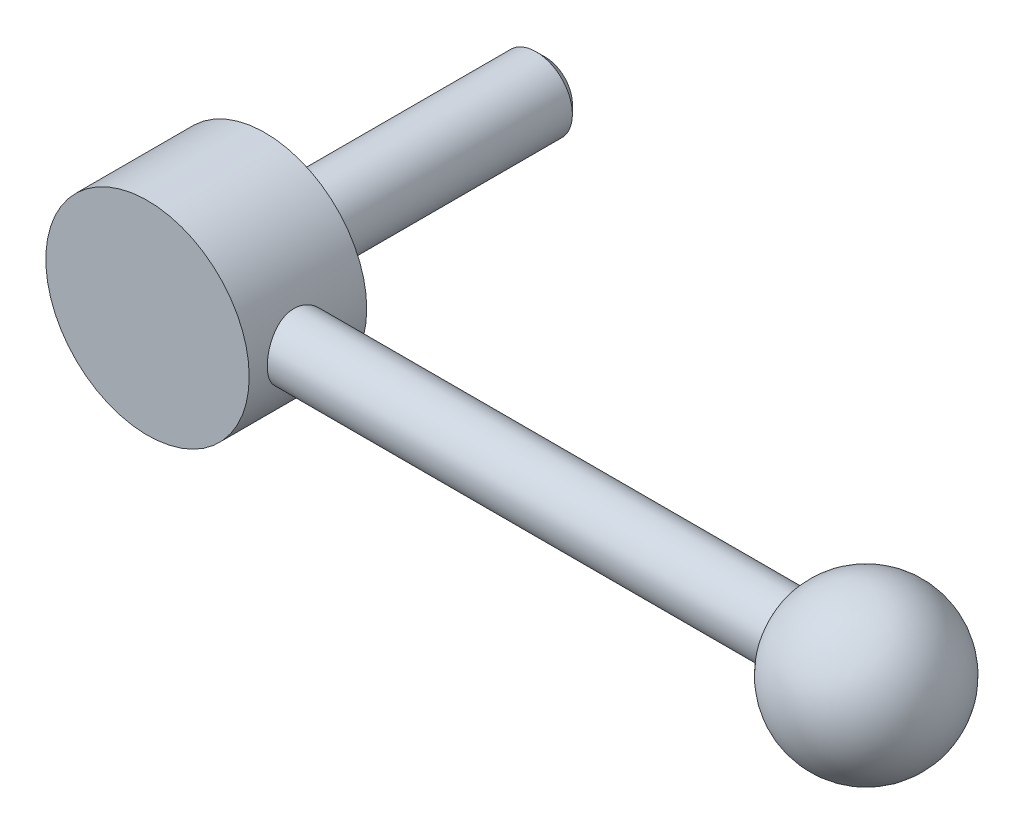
ISO-10303-21;
HEADER;
FILE_DESCRIPTION(('STEP AP214'),'2;1');
FILE_NAME('part.step','',(''),(''),'','','');
FILE_SCHEMA(('AUTOMOTIVE_DESIGN { 1 0 10303 214 1 1 1 1 }'));
ENDSEC;
DATA;
#1=APPLICATION_CONTEXT('core data for automotive mechanical design processes');
#2=APPLICATION_PROTOCOL_DEFINITION('international standard','automotive_design',2000,#1);
#3=PRODUCT_CONTEXT('',#1,'mechanical');
#4=PRODUCT('Part','Part','',(#3));
#5=PRODUCT_RELATED_PRODUCT_CATEGORY('part','',(#4));
#6=PRODUCT_DEFINITION_FORMATION('','',#4);
#7=PRODUCT_DEFINITION_CONTEXT('part definition',#1,'design');
#8=PRODUCT_DEFINITION('design','',#6,#7);
#9=PRODUCT_DEFINITION_SHAPE('','',#8);
#10=(LENGTH_UNIT() NAMED_UNIT(*) SI_UNIT(.MILLI.,.METRE.));
#11=(NAMED_UNIT(*) PLANE_ANGLE_UNIT() SI_UNIT($,.RADIAN.));
#12=(NAMED_UNIT(*) SI_UNIT($,.STERADIAN.) SOLID_ANGLE_UNIT());
#13=UNCERTAINTY_MEASURE_WITH_UNIT(LENGTH_MEASURE(1.E-05),#10,'distance_accuracy_value','');
#14=(GEOMETRIC_REPRESENTATION_CONTEXT(3) GLOBAL_UNCERTAINTY_ASSIGNED_CONTEXT((#13)) GLOBAL_UNIT_ASSIGNED_CONTEXT((#10,
#11,#12)) REPRESENTATION_CONTEXT('',''));
#15=CARTESIAN_POINT('',(0.,0.,0.));
#16=DIRECTION('',(0.,0.,1.));
#17=DIRECTION('',(1.,0.,0.));
#18=AXIS2_PLACEMENT_3D('',#15,#16,#17);
#19=CARTESIAN_POINT('',(0.,0.,40.));
#20=DIRECTION('',(0.,0.,1.));
#21=DIRECTION('',(1.,0.,0.));
#22=AXIS2_PLACEMENT_3D('',#19,#20,#21);
#23=CYLINDRICAL_SURFACE('',#22,11.5);
#24=CARTESIAN_POINT('',(0.,0.,2.));
#25=DIRECTION('',(0.,0.,1.));
#26=DIRECTION('',(1.,0.,0.));
#27=AXIS2_PLACEMENT_3D('',#24,#25,#26);
#28=CIRCLE('',#27,11.5);
#29=CARTESIAN_POINT('',(11.5,0.,2.));
#30=VERTEX_POINT('',#29);
#31=EDGE_CURVE('E37',#30,#30,#28,.T.);
#32=ORIENTED_EDGE('',*,*,#31,.F.);
#33=EDGE_LOOP('',(#32));
#34=FACE_BOUND('',#33,.T.);
#35=CARTESIAN_POINT('',(0.,0.,0.));
#36=DIRECTION('',(0.,0.,1.));
#37=DIRECTION('',(1.,0.,0.));
#38=AXIS2_PLACEMENT_3D('',#35,#36,#37);
#39=CIRCLE('',#38,11.5);
#40=CARTESIAN_POINT('',(11.5,0.,0.));
#41=VERTEX_POINT('',#40);
#42=EDGE_CURVE('E23',#41,#41,#39,.T.);
#43=ORIENTED_EDGE('',*,*,#42,.T.);
#44=EDGE_LOOP('',(#43));
#45=FACE_BOUND('',#44,.T.);
#46=ADVANCED_FACE('F12',(#34,#45),#23,.T.);
#47=CARTESIAN_POINT('',(8.,0.,0.));
#48=DIRECTION('',(0.,0.,1.));
#49=DIRECTION('',(1.,0.,0.));
#50=AXIS2_PLACEMENT_3D('',#47,#48,#49);
#51=PLANE('',#50);
#52=ORIENTED_EDGE('',*,*,#42,.F.);
#53=EDGE_LOOP('',(#52));
#54=FACE_BOUND('',#53,.T.);
#55=CARTESIAN_POINT('',(0.,0.,0.));
#56=DIRECTION('',(0.,0.,1.));
#57=DIRECTION('',(1.,0.,0.));
#58=AXIS2_PLACEMENT_3D('',#55,#56,#57);
#59=CIRCLE('',#58,8.);
#60=CARTESIAN_POINT('',(8.,0.,0.));
#61=VERTEX_POINT('',#60);
#62=EDGE_CURVE('E27',#61,#61,#59,.T.);
#63=ORIENTED_EDGE('',*,*,#62,.T.);
#64=EDGE_LOOP('',(#63));
#65=FACE_BOUND('',#64,.T.);
#66=ADVANCED_FACE('F63',(#54,#65),#51,.F.);
#67=CARTESIAN_POINT('',(0.,0.,40.));
#68=DIRECTION('',(0.,0.,1.));
#69=DIRECTION('',(1.,0.,0.));
#70=AXIS2_PLACEMENT_3D('',#67,#68,#69);
#71=CYLINDRICAL_SURFACE('',#70,8.);
#72=CARTESIAN_POINT('',(0.,0.,-58.));
#73=DIRECTION('',(0.,0.,-1.));
#74=DIRECTION('',(-1.,0.,0.));
#75=AXIS2_PLACEMENT_3D('',#72,#73,#74);
#76=CIRCLE('',#75,8.);
#77=CARTESIAN_POINT('',(-8.,0.,-58.));
#78=VERTEX_POINT('',#77);
#79=EDGE_CURVE('E19',#78,#78,#76,.F.);
#80=ORIENTED_EDGE('',*,*,#79,.T.);
#81=EDGE_LOOP('',(#80));
#82=FACE_BOUND('',#81,.T.);
#83=ORIENTED_EDGE('',*,*,#62,.F.);
#84=EDGE_LOOP('',(#83));
#85=FACE_BOUND('',#84,.T.);
#86=ADVANCED_FACE('F69',(#82,#85),#71,.T.);
#87=CARTESIAN_POINT('',(8.,0.,-60.));
#88=DIRECTION('',(0.,0.,-1.));
#89=DIRECTION('',(-1.,0.,0.));
#90=AXIS2_PLACEMENT_3D('',#87,#88,#89);
#91=PLANE('',#90);
#92=CARTESIAN_POINT('',(0.,0.,-60.));
#93=DIRECTION('',(0.,0.,-1.));
#94=DIRECTION('',(-1.,0.,0.));
#95=AXIS2_PLACEMENT_3D('',#92,#93,#94);
#96=CIRCLE('',#95,6.);
#97=CARTESIAN_POINT('',(-6.,0.,-60.));
#98=VERTEX_POINT('',#97);
#99=EDGE_CURVE('E8',#98,#98,#96,.T.);
#100=ORIENTED_EDGE('',*,*,#99,.T.);
#101=EDGE_LOOP('',(#100));
#102=FACE_BOUND('',#101,.T.);
#103=ADVANCED_FACE('F77',(#102),#91,.T.);
#104=CARTESIAN_POINT('',(22.5,0.,28.));
#105=DIRECTION('',(0.,0.,-1.));
#106=DIRECTION('',(-1.,0.,0.));
#107=AXIS2_PLACEMENT_3D('',#104,#105,#106);
#108=PLANE('',#107);
#109=CARTESIAN_POINT('',(0.,0.,28.));
#110=DIRECTION('',(0.,0.,1.));
#111=DIRECTION('',(1.,0.,0.));
#112=AXIS2_PLACEMENT_3D('',#109,#110,#111);
#113=CIRCLE('',#112,22.5);
#114=CARTESIAN_POINT('',(22.5,0.,28.));
#115=VERTEX_POINT('',#114);
#116=EDGE_CURVE('E86',#115,#115,#113,.T.);
#117=ORIENTED_EDGE('',*,*,#116,.T.);
#118=EDGE_LOOP('',(#117));
#119=FACE_BOUND('',#118,.T.);
#120=ADVANCED_FACE('F58',(#119),#108,.F.);
#121=CARTESIAN_POINT('',(0.,0.,40.));
#122=DIRECTION('',(0.,0.,1.));
#123=DIRECTION('',(1.,0.,0.));
#124=AXIS2_PLACEMENT_3D('',#121,#122,#123);
#125=CYLINDRICAL_SURFACE('',#124,22.5);
#126=CARTESIAN_POINT('',(22.5,0.,10.));
#127=CARTESIAN_POINT('',(22.4999998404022,-0.191677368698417,10.0000002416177));
#128=CARTESIAN_POINT('',(22.4975448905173,-0.383358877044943,10.0078793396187));
#129=CARTESIAN_POINT('',(22.4877923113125,-0.765308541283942,10.0393229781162));
#130=CARTESIAN_POINT('',(22.4804945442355,-0.955576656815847,10.0628879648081));
#131=CARTESIAN_POINT('',(22.4612564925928,-1.33331254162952,10.1254869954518));
#132=CARTESIAN_POINT('',(22.4493161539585,-1.52078027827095,10.1645212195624));
#133=CARTESIAN_POINT('',(22.4211118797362,-1.89165112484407,10.2577281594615));
#134=CARTESIAN_POINT('',(22.4048463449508,-2.07505270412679,10.3119064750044));
#135=CARTESIAN_POINT('',(22.3684646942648,-2.43611329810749,10.4348153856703));
#136=CARTESIAN_POINT('',(22.3483561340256,-2.61378279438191,10.503517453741));
#137=CARTESIAN_POINT('',(22.3047888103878,-2.96265393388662,10.6550124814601));
#138=CARTESIAN_POINT('',(22.281328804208,-3.13385314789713,10.7378106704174));
#139=CARTESIAN_POINT('',(22.2316747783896,-3.46860942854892,10.9168465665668));
#140=CARTESIAN_POINT('',(22.2054814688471,-3.63216846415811,11.0130807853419));
#141=CARTESIAN_POINT('',(22.1510251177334,-3.95072830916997,11.2183306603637));
#142=CARTESIAN_POINT('',(22.1227612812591,-4.10572579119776,11.327351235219));
#143=CARTESIAN_POINT('',(22.0343532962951,-4.56462383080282,11.6788046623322));
#144=CARTESIAN_POINT('',(21.9719820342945,-4.85343322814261,11.9408249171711));
#145=CARTESIAN_POINT('',(21.8481078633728,-5.38374028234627,12.5092913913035));
#146=CARTESIAN_POINT('',(21.7866051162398,-5.62522922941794,12.8157457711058));
#147=CARTESIAN_POINT('',(21.6993823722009,-5.94977072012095,13.3067462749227));
#148=CARTESIAN_POINT('',(21.670827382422,-6.05269326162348,13.4779461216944));
#149=CARTESIAN_POINT('',(21.6165738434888,-6.24368405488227,13.8288405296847));
#150=CARTESIAN_POINT('',(21.5908741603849,-6.33175821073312,14.0085316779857));
#151=CARTESIAN_POINT('',(21.5431267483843,-6.49235835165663,14.3752387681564));
#152=CARTESIAN_POINT('',(21.5210797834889,-6.56488108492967,14.5622562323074));
#153=CARTESIAN_POINT('',(21.4813641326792,-6.69369414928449,14.9421700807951));
#154=CARTESIAN_POINT('',(21.4636935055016,-6.74999167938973,15.1350638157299));
#155=CARTESIAN_POINT('',(21.4337574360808,-6.84444485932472,15.5195916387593));
#156=CARTESIAN_POINT('',(21.4213480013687,-6.88308642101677,15.7110952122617));
#157=CARTESIAN_POINT('',(21.4016029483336,-6.94423696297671,16.0968445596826));
#158=CARTESIAN_POINT('',(21.3942652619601,-6.96675251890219,16.2910891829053));
#159=CARTESIAN_POINT('',(21.3848978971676,-6.99545358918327,16.6809027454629));
#160=CARTESIAN_POINT('',(21.382868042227,-7.00163964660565,16.8764716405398));
#161=CARTESIAN_POINT('',(21.3841835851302,-6.99762087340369,17.2674203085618));
#162=CARTESIAN_POINT('',(21.387528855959,-6.98741643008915,17.4628000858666));
#163=CARTESIAN_POINT('',(21.3992467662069,-6.95144410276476,17.8441910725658));
#164=CARTESIAN_POINT('',(21.4074162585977,-6.92630487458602,18.0302682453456));
#165=CARTESIAN_POINT('',(21.4283669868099,-6.86121389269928,18.3996136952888));
#166=CARTESIAN_POINT('',(21.4411497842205,-6.82125712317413,18.5828809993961));
#167=CARTESIAN_POINT('',(21.4709424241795,-6.7268919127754,18.9452428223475));
#168=CARTESIAN_POINT('',(21.4879510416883,-6.67248765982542,19.1243385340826));
#169=CARTESIAN_POINT('',(21.5257120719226,-6.54964475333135,19.4773149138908));
#170=CARTESIAN_POINT('',(21.5464659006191,-6.48120079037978,19.6511935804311));
#171=CARTESIAN_POINT('',(21.5914465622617,-6.32975192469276,19.9949996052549));
#172=CARTESIAN_POINT('',(21.6157183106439,-6.24655500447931,20.1648364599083));
#173=CARTESIAN_POINT('',(21.6668400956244,-6.06685791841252,20.4969847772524));
#174=CARTESIAN_POINT('',(21.6936910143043,-5.97035319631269,20.6592936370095));
#175=CARTESIAN_POINT('',(21.749239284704,-5.76471421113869,20.9753768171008));
#176=CARTESIAN_POINT('',(21.777936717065,-5.65557939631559,21.1291507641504));
#177=CARTESIAN_POINT('',(21.836423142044,-5.42537787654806,21.4272728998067));
#178=CARTESIAN_POINT('',(21.866212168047,-5.30431080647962,21.5716207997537));
#179=CARTESIAN_POINT('',(21.9274745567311,-5.0452320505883,21.8563713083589));
#180=CARTESIAN_POINT('',(21.958963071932,-4.90670110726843,21.9962986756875));
#181=CARTESIAN_POINT('',(22.0214157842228,-4.61833304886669,22.2639997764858));
#182=CARTESIAN_POINT('',(22.0523801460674,-4.46849957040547,22.3917773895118));
#183=CARTESIAN_POINT('',(22.1129608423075,-4.15835706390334,22.6344343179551));
#184=CARTESIAN_POINT('',(22.142576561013,-3.99804333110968,22.749307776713));
#185=CARTESIAN_POINT('',(22.1996210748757,-3.66808403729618,22.9652340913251));
#186=CARTESIAN_POINT('',(22.2270507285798,-3.4984421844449,23.0662923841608));
#187=CARTESIAN_POINT('',(22.2791891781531,-3.14946058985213,23.2546406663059));
#188=CARTESIAN_POINT('',(22.3038740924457,-2.97005333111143,23.341812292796));
#189=CARTESIAN_POINT('',(22.3495532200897,-2.60412187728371,23.5006396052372));
#190=CARTESIAN_POINT('',(22.3705488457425,-2.41760043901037,23.5723012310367));
#191=CARTESIAN_POINT('',(22.4082535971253,-2.03872672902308,23.6995165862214));
#192=CARTESIAN_POINT('',(22.4249629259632,-1.84637473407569,23.7550710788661));
#193=CARTESIAN_POINT('',(22.4536048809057,-1.45728257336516,23.8495549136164));
#194=CARTESIAN_POINT('',(22.4655376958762,-1.26054258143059,23.8884849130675));
#195=CARTESIAN_POINT('',(22.4839130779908,-0.871811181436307,23.948173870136));
#196=CARTESIAN_POINT('',(22.4905485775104,-0.679926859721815,23.9695722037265));
#197=CARTESIAN_POINT('',(22.4988905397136,-0.294941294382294,23.9964448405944));
#198=CARTESIAN_POINT('',(22.5005971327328,-0.101840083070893,24.001919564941));
#199=CARTESIAN_POINT('',(22.4990337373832,0.284107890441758,23.9968939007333));
#200=CARTESIAN_POINT('',(22.4957643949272,0.476954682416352,23.9863955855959));
#201=CARTESIAN_POINT('',(22.4843416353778,0.860977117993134,23.9495270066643));
#202=CARTESIAN_POINT('',(22.4761882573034,1.0521527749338,23.9231568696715));
#203=CARTESIAN_POINT('',(22.4554847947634,1.42671362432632,23.8556400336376));
#204=CARTESIAN_POINT('',(22.4430488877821,1.61017439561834,23.8148764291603));
#205=CARTESIAN_POINT('',(22.4140684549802,1.97298394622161,23.7188213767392));
#206=CARTESIAN_POINT('',(22.3975225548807,2.15233132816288,23.6635250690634));
#207=CARTESIAN_POINT('',(22.3607552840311,2.50562583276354,23.5388775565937));
#208=CARTESIAN_POINT('',(22.3405349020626,2.67957439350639,23.4695301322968));
#209=CARTESIAN_POINT('',(22.2969201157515,3.02109307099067,23.3172751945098));
#210=CARTESIAN_POINT('',(22.2735245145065,3.18866075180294,23.2343625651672));
#211=CARTESIAN_POINT('',(22.2235592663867,3.5202550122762,23.0534553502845));
#212=CARTESIAN_POINT('',(22.196927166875,3.68410148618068,22.9551479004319));
#213=CARTESIAN_POINT('',(22.1416334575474,4.00303333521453,22.7456195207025));
#214=CARTESIAN_POINT('',(22.1129711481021,4.15811565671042,22.6343941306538));
#215=CARTESIAN_POINT('',(22.0543595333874,4.45854845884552,22.3997845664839));
#216=CARTESIAN_POINT('',(22.0244101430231,4.60389829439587,22.2763995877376));
#217=CARTESIAN_POINT('',(21.9639950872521,4.88399953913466,22.0182492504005));
#218=CARTESIAN_POINT('',(21.9335294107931,5.01875072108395,21.8834836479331));
#219=CARTESIAN_POINT('',(21.8716714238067,5.28194864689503,21.5978479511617));
#220=CARTESIAN_POINT('',(21.8402900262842,5.40993633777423,21.446552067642));
#221=CARTESIAN_POINT('',(21.778722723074,5.65269114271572,21.133557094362));
#222=CARTESIAN_POINT('',(21.7485364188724,5.7674626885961,20.9718615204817));
#223=CARTESIAN_POINT('',(21.6902133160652,5.98307012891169,20.6389845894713));
#224=CARTESIAN_POINT('',(21.6620773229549,6.08390056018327,20.4677995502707));
#225=CARTESIAN_POINT('',(21.6087222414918,6.27077082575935,20.1171905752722));
#226=CARTESIAN_POINT('',(21.5835019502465,6.35681676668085,19.9377700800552));
#227=CARTESIAN_POINT('',(21.5368298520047,6.51318654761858,19.5724944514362));
#228=CARTESIAN_POINT('',(21.5153649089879,6.58356543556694,19.3866645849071));
#229=CARTESIAN_POINT('',(21.4767854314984,6.70834974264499,19.0093553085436));
#230=CARTESIAN_POINT('',(21.4596691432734,6.76276160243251,18.8178782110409));
#231=CARTESIAN_POINT('',(21.4303403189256,6.85513428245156,18.4306463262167));
#232=CARTESIAN_POINT('',(21.4181272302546,6.89309695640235,18.2348920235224));
#233=CARTESIAN_POINT('',(21.3990152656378,6.95220219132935,17.8406058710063));
#234=CARTESIAN_POINT('',(21.3921161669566,6.97334545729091,17.6420741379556));
#235=CARTESIAN_POINT('',(21.3840536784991,6.99802863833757,17.2527924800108));
#236=CARTESIAN_POINT('',(21.3826459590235,7.00231848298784,17.0620947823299));
#237=CARTESIAN_POINT('',(21.3849355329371,6.99532322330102,16.6809486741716));
#238=CARTESIAN_POINT('',(21.3886345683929,6.98403280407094,16.4905003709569));
#239=CARTESIAN_POINT('',(21.4010215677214,6.94598254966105,16.1114036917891));
#240=CARTESIAN_POINT('',(21.4097074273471,6.91922923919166,15.9227545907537));
#241=CARTESIAN_POINT('',(21.4317998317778,6.8504931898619,15.5484622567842));
#242=CARTESIAN_POINT('',(21.445208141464,6.80850475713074,15.3628201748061));
#243=CARTESIAN_POINT('',(21.4761044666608,6.7104051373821,14.9986247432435));
#244=CARTESIAN_POINT('',(21.4935291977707,6.65451205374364,14.8200071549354));
#245=CARTESIAN_POINT('',(21.532065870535,6.52874130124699,14.4681109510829));
#246=CARTESIAN_POINT('',(21.553179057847,6.45885890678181,14.294834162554));
#247=CARTESIAN_POINT('',(21.598497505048,6.30565478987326,13.9547580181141));
#248=CARTESIAN_POINT('',(21.622702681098,6.22233343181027,13.7879584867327));
#249=CARTESIAN_POINT('',(21.6735512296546,6.04283665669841,13.4618116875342));
#250=CARTESIAN_POINT('',(21.7001947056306,5.94666069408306,13.3024647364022));
#251=CARTESIAN_POINT('',(21.7562945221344,5.73809693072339,12.9860832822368));
#252=CARTESIAN_POINT('',(21.7858200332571,5.62522322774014,12.8293812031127));
#253=CARTESIAN_POINT('',(21.8459271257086,5.38707171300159,12.5260042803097));
#254=CARTESIAN_POINT('',(21.876508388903,5.26179761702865,12.3793264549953));
#255=CARTESIAN_POINT('',(21.9379319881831,4.9995285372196,12.0967465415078));
#256=CARTESIAN_POINT('',(21.9687744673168,4.86252669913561,11.9608508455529));
#257=CARTESIAN_POINT('',(22.0298741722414,4.57775496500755,11.7008184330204));
#258=CARTESIAN_POINT('',(22.0601315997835,4.42998886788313,11.5766776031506));
#259=CARTESIAN_POINT('',(22.1202447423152,4.11953578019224,11.3370395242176));
#260=CARTESIAN_POINT('',(22.1500549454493,3.95651883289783,11.2219578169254));
#261=CARTESIAN_POINT('',(22.207366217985,3.62102613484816,11.0060070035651));
#262=CARTESIAN_POINT('',(22.2348681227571,3.44855384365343,10.9051327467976));
#263=CARTESIAN_POINT('',(22.286793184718,3.09527336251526,10.7183440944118));
#264=CARTESIAN_POINT('',(22.3112167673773,2.91446632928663,10.6324276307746));
#265=CARTESIAN_POINT('',(22.3562872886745,2.54576090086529,10.4762606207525));
#266=CARTESIAN_POINT('',(22.3769345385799,2.35786309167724,10.4060087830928));
#267=CARTESIAN_POINT('',(22.4122437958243,1.99297373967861,10.2872063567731));
#268=CARTESIAN_POINT('',(22.4272705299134,1.81645819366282,10.2372983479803));
#269=CARTESIAN_POINT('',(22.4533075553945,1.45977603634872,10.1514456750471));
#270=CARTESIAN_POINT('',(22.4643180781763,1.27960963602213,10.1155002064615));
#271=CARTESIAN_POINT('',(22.4820479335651,0.916792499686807,10.0578654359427));
#272=CARTESIAN_POINT('',(22.4887670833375,0.734141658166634,10.0361767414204));
#273=CARTESIAN_POINT('',(22.4977423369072,0.36766149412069,10.007246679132));
#274=CARTESIAN_POINT('',(22.500000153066,0.183832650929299,9.99999976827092));
#275=CARTESIAN_POINT('',(22.5,0.,10.));
#276=B_SPLINE_CURVE_WITH_KNOTS('',3,(#126,#127,#128,#129,#130,#131,#132,#133,#134,#135,#136,
#137,#138,#139,#140,#141,#142,#143,#144,#145,#146,#147,#148,#149,#150,#151,#152,#153,#154,#155,
#156,#157,#158,#159,#160,#161,#162,#163,#164,#165,#166,#167,#168,#169,#170,#171,#172,#173,#174,
#175,#176,#177,#178,#179,#180,#181,#182,#183,#184,#185,#186,#187,#188,#189,#190,#191,#192,#193,
#194,#195,#196,#197,#198,#199,#200,#201,#202,#203,#204,#205,#206,#207,#208,#209,#210,#211,#212,
#213,#214,#215,#216,#217,#218,#219,#220,#221,#222,#223,#224,#225,#226,#227,#228,#229,#230,#231,
#232,#233,#234,#235,#236,#237,#238,#239,#240,#241,#242,#243,#244,#245,#246,#247,#248,#249,#250,
#251,#252,#253,#254,#255,#256,#257,#258,#259,#260,#261,#262,#263,#264,#265,#266,#267,#268,#269,
#270,#271,#272,#273,#274,#275),.UNSPECIFIED.,.T.,.F.,(4,2,2,2,2,2,2,2,2,2,2,2,2,2,2,2,2,2,2,2,2,
2,2,2,2,2,2,2,2,2,2,2,2,2,2,2,2,2,2,2,2,2,2,2,2,2,2,2,2,2,2,2,2,2,2,2,2,2,2,2,2,2,2,2,2,2,2,2,2,
2,2,2,2,2,4),(0.,0.574862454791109,1.14974126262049,1.72462676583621,2.29972512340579,
2.87370421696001,3.44789670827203,4.02194039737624,4.59620563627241,5.77524816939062,
6.95450751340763,7.55923977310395,8.16373100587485,8.76834851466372,9.37269734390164,
9.95922932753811,10.5455220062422,11.1317951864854,11.7180545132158,12.2812290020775,
12.8445943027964,13.4077964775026,13.9712120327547,14.5425858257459,15.1141557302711,
15.6857506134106,16.2573629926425,16.85487964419,17.4522048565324,18.0498000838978,
18.6471594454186,19.2493655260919,19.8513405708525,20.4532870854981,21.0552097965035,
21.6340578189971,22.2128905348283,22.7916481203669,23.3704010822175,23.9347859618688,
24.499359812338,25.0637819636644,25.6284174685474,26.2065358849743,26.7848545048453,
27.3632114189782,27.9415807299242,28.5427881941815,29.1437934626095,29.74503358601,
30.3460247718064,30.9448697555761,31.5434728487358,32.1420084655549,32.7405189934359,
33.3120739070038,33.8838238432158,34.4553327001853,35.0270553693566,35.5903206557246,
36.1537765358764,36.7172171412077,37.2806816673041,37.8661164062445,38.4513762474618,
39.0369805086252,39.6223790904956,40.2269255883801,40.8312523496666,41.4354954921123,
42.0396888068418,42.5912440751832,43.1427675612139,43.6943145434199,44.2456497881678),.UNSPECIFIED.);
#277=CARTESIAN_POINT('',(22.5,0.,10.));
#278=VERTEX_POINT('',#277);
#279=EDGE_CURVE('E30',#278,#278,#276,.T.);
#280=ORIENTED_EDGE('',*,*,#279,.T.);
#281=EDGE_LOOP('',(#280));
#282=FACE_BOUND('',#281,.T.);
#283=ORIENTED_EDGE('',*,*,#116,.F.);
#284=EDGE_LOOP('',(#283));
#285=FACE_BOUND('',#284,.T.);
#286=CARTESIAN_POINT('',(0.,0.,2.));
#287=DIRECTION('',(0.,0.,1.));
#288=DIRECTION('',(1.,0.,0.));
#289=AXIS2_PLACEMENT_3D('',#286,#287,#288);
#290=CIRCLE('',#289,22.5);
#291=CARTESIAN_POINT('',(22.5,0.,2.));
#292=VERTEX_POINT('',#291);
#293=EDGE_CURVE('E88',#292,#292,#290,.T.);
#294=ORIENTED_EDGE('',*,*,#293,.T.);
#295=EDGE_LOOP('',(#294));
#296=FACE_BOUND('',#295,.T.);
#297=ADVANCED_FACE('F40',(#282,#285,#296),#125,.T.);
#298=CARTESIAN_POINT('',(11.5,0.,2.));
#299=DIRECTION('',(0.,0.,1.));
#300=DIRECTION('',(1.,0.,0.));
#301=AXIS2_PLACEMENT_3D('',#298,#299,#300);
#302=PLANE('',#301);
#303=ORIENTED_EDGE('',*,*,#293,.F.);
#304=EDGE_LOOP('',(#303));
#305=FACE_BOUND('',#304,.T.);
#306=ORIENTED_EDGE('',*,*,#31,.T.);
#307=EDGE_LOOP('',(#306));
#308=FACE_BOUND('',#307,.T.);
#309=ADVANCED_FACE('F49',(#305,#308),#302,.F.);
#310=CARTESIAN_POINT('',(-30.,0.,17.));
#311=DIRECTION('',(-1.,0.,0.));
#312=DIRECTION('',(0.,0.,1.));
#313=AXIS2_PLACEMENT_3D('',#310,#311,#312);
#314=CYLINDRICAL_SURFACE('',#313,7.);
#315=CARTESIAN_POINT('',(131.960985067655,0.,17.));
#316=DIRECTION('',(-1.,0.,0.));
#317=DIRECTION('',(0.,0.,1.));
#318=AXIS2_PLACEMENT_3D('',#315,#316,#317);
#319=CIRCLE('',#318,7.);
#320=CARTESIAN_POINT('',(131.960985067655,0.,24.));
#321=VERTEX_POINT('',#320);
#322=EDGE_CURVE('E38',#321,#321,#319,.T.);
#323=ORIENTED_EDGE('',*,*,#322,.T.);
#324=EDGE_LOOP('',(#323));
#325=FACE_BOUND('',#324,.T.);
#326=ORIENTED_EDGE('',*,*,#279,.F.);
#327=EDGE_LOOP('',(#326));
#328=FACE_BOUND('',#327,.T.);
#329=ADVANCED_FACE('F44',(#325,#328),#314,.T.);
#330=CARTESIAN_POINT('',(148.,0.,17.));
#331=DIRECTION('',(0.,0.,1.));
#332=DIRECTION('',(1.,0.,0.));
#333=AXIS2_PLACEMENT_3D('',#330,#331,#332);
#334=SPHERICAL_SURFACE('',#333,17.5);
#335=CARTESIAN_POINT('',(148.,0.,17.));
#336=DIRECTION('',(-1.,0.,0.));
#337=DIRECTION('',(0.,0.,1.));
#338=AXIS2_PLACEMENT_3D('',#335,#336,#337);
#339=SPHERICAL_SURFACE('',#338,17.5);
#340=ORIENTED_EDGE('',*,*,#322,.F.);
#341=EDGE_LOOP('',(#340));
#342=FACE_BOUND('',#341,.T.);
#343=ADVANCED_FACE('F48',(#342),#339,.T.);
#344=CARTESIAN_POINT('',(0.,0.,-58.));
#345=DIRECTION('',(0.,0.,1.));
#346=DIRECTION('',(1.,0.,0.));
#347=AXIS2_PLACEMENT_3D('',#344,#345,#346);
#348=CONICAL_SURFACE('',#347,8.,0.785398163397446);
#349=ORIENTED_EDGE('',*,*,#99,.F.);
#350=EDGE_LOOP('',(#349));
#351=FACE_BOUND('',#350,.T.);
#352=ORIENTED_EDGE('',*,*,#79,.F.);
#353=EDGE_LOOP('',(#352));
#354=FACE_BOUND('',#353,.T.);
#355=ADVANCED_FACE('F14',(#351,#354),#348,.T.);
#356=CLOSED_SHELL('',(#46,#66,#86,#103,#120,#297,#309,#329,#343,#355));
#357=MANIFOLD_SOLID_BREP('B1',#356);
#358=ADVANCED_BREP_SHAPE_REPRESENTATION('',(#18,#357),#14);
#359=SHAPE_DEFINITION_REPRESENTATION(#9,#358);
ENDSEC;
END-ISO-10303-21;
